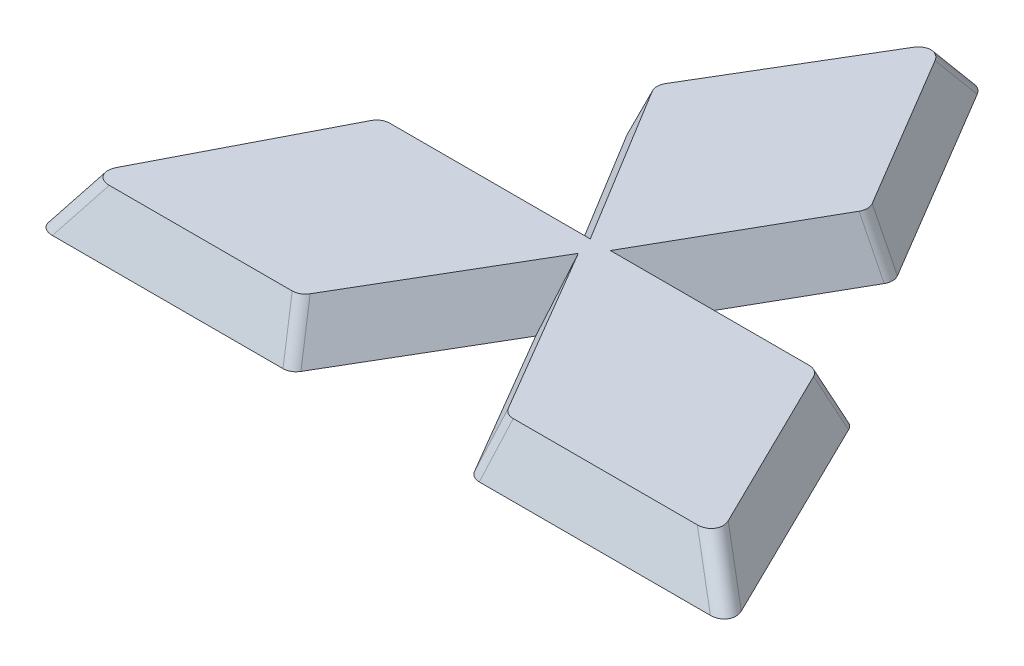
ISO-10303-21;
HEADER;
FILE_DESCRIPTION(('STEP AP214'),'2;1');
FILE_NAME('part.step','',(''),(''),'','','');
FILE_SCHEMA(('AUTOMOTIVE_DESIGN { 1 0 10303 214 1 1 1 1 }'));
ENDSEC;
DATA;
#1=APPLICATION_CONTEXT('core data for automotive mechanical design processes');
#2=APPLICATION_PROTOCOL_DEFINITION('international standard','automotive_design',2000,#1);
#3=PRODUCT_CONTEXT('',#1,'mechanical');
#4=PRODUCT('Part','Part','',(#3));
#5=PRODUCT_RELATED_PRODUCT_CATEGORY('part','',(#4));
#6=PRODUCT_DEFINITION_FORMATION('','',#4);
#7=PRODUCT_DEFINITION_CONTEXT('part definition',#1,'design');
#8=PRODUCT_DEFINITION('design','',#6,#7);
#9=PRODUCT_DEFINITION_SHAPE('','',#8);
#10=(LENGTH_UNIT() NAMED_UNIT(*) SI_UNIT(.MILLI.,.METRE.));
#11=(NAMED_UNIT(*) PLANE_ANGLE_UNIT() SI_UNIT($,.RADIAN.));
#12=(NAMED_UNIT(*) SI_UNIT($,.STERADIAN.) SOLID_ANGLE_UNIT());
#13=UNCERTAINTY_MEASURE_WITH_UNIT(LENGTH_MEASURE(1.E-05),#10,'distance_accuracy_value','');
#14=(GEOMETRIC_REPRESENTATION_CONTEXT(3) GLOBAL_UNCERTAINTY_ASSIGNED_CONTEXT((#13)) GLOBAL_UNIT_ASSIGNED_CONTEXT((#10,
#11,#12)) REPRESENTATION_CONTEXT('',''));
#15=CARTESIAN_POINT('',(0.,0.,0.));
#16=DIRECTION('',(0.,0.,1.));
#17=DIRECTION('',(1.,0.,0.));
#18=AXIS2_PLACEMENT_3D('',#15,#16,#17);
#19=CARTESIAN_POINT('',(0.,0.,0.));
#20=DIRECTION('',(0.,-1.,0.));
#21=DIRECTION('',(0.,0.,-1.));
#22=AXIS2_PLACEMENT_3D('',#19,#20,#21);
#23=PLANE('',#22);
#24=DIRECTION('',(-0.511435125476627,0.,0.859321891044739));
#25=VECTOR('',#24,1.);
#26=CARTESIAN_POINT('',(0.,0.,-42.));
#27=LINE('',#26,#25);
#28=CARTESIAN_POINT('',(-1.57968289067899,0.,-39.3457902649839));
#29=VERTEX_POINT('',#28);
#30=CARTESIAN_POINT('',(-17.8834969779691,0.,-11.9518478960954));
#31=VERTEX_POINT('',#30);
#32=EDGE_CURVE('E419',#29,#31,#27,.T.);
#33=ORIENTED_EDGE('',*,*,#32,.F.);
#34=CARTESIAN_POINT('',(0.,0.,-37.7454326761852));
#35=DIRECTION('',(0.,-1.,0.));
#36=DIRECTION('',(0.,0.,-1.));
#37=AXIS2_PLACEMENT_3D('',#34,#35,#36);
#38=ELLIPSE('',#37,2.60937331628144,2.);
#39=CARTESIAN_POINT('',(1.57968289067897,0.,-39.3457902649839));
#40=VERTEX_POINT('',#39);
#41=EDGE_CURVE('E845',#29,#40,#38,.T.);
#42=ORIENTED_EDGE('',*,*,#41,.T.);
#43=DIRECTION('',(-0.511435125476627,0.,-0.859321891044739));
#44=VECTOR('',#43,1.);
#45=CARTESIAN_POINT('',(0.,0.,-42.));
#46=LINE('',#45,#44);
#47=CARTESIAN_POINT('',(17.9023421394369,0.,-11.9201839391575));
#48=VERTEX_POINT('',#47);
#49=EDGE_CURVE('E658',#48,#40,#46,.T.);
#50=ORIENTED_EDGE('',*,*,#49,.F.);
#51=CARTESIAN_POINT('',(15.9319231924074,0.,-10.976347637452));
#52=DIRECTION('',(0.,-1.,0.));
#53=DIRECTION('',(0.999955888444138,0.,-0.00939261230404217));
#54=AXIS2_PLACEMENT_3D('',#51,#52,#53);
#55=ELLIPSE('',#54,2.23248520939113,2.);
#56=CARTESIAN_POINT('',(17.9197238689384,0.,-10.0696909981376));
#57=VERTEX_POINT('',#56);
#58=EDGE_CURVE('E835',#48,#57,#55,.T.);
#59=ORIENTED_EDGE('',*,*,#58,.T.);
#60=DIRECTION('',(0.495203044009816,0.,-0.868777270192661));
#61=VECTOR('',#60,1.);
#62=CARTESIAN_POINT('',(18.45,0.,-11.));
#63=LINE('',#62,#61);
#64=CARTESIAN_POINT('',(7.05000000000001,0.,9.00000000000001));
#65=VERTEX_POINT('',#64);
#66=EDGE_CURVE('E279',#65,#57,#63,.T.);
#67=ORIENTED_EDGE('',*,*,#66,.F.);
#68=DIRECTION('',(-1.,0.,0.));
#69=VECTOR('',#68,1.);
#70=CARTESIAN_POINT('',(32.55,0.,9.));
#71=LINE('',#70,#69);
#72=CARTESIAN_POINT('',(31.4045816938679,0.,9.));
#73=VERTEX_POINT('',#72);
#74=EDGE_CURVE('E232',#73,#65,#71,.T.);
#75=ORIENTED_EDGE('',*,*,#74,.F.);
#76=CARTESIAN_POINT('',(31.1941987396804,0.,11.175935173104));
#77=DIRECTION('',(0.,-1.,0.));
#78=DIRECTION('',(0.528832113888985,0.,-0.848726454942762));
#79=AXIS2_PLACEMENT_3D('',#76,#77,#78);
#80=ELLIPSE('',#79,2.24052033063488,2.);
#81=CARTESIAN_POINT('',(33.05475513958,0.,10.0282049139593));
#82=VERTEX_POINT('',#81);
#83=EDGE_CURVE('E830',#73,#82,#80,.T.);
#84=ORIENTED_EDGE('',*,*,#83,.T.);
#85=DIRECTION('',(-0.440673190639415,0.,-0.89766761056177));
#86=VECTOR('',#85,1.);
#87=CARTESIAN_POINT('',(32.55,0.,9.));
#88=LINE('',#87,#86);
#89=CARTESIAN_POINT('',(47.4498885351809,0.,39.351624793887));
#90=VERTEX_POINT('',#89);
#91=EDGE_CURVE('E510',#90,#82,#88,.T.);
#92=ORIENTED_EDGE('',*,*,#91,.F.);
#93=CARTESIAN_POINT('',(45.2578260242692,0.,39.824064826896));
#94=DIRECTION('',(0.,-1.,0.));
#95=DIRECTION('',(0.848726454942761,0.,0.528832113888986));
#96=AXIS2_PLACEMENT_3D('',#93,#94,#95);
#97=ELLIPSE('',#96,2.57430860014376,2.);
#98=CARTESIAN_POINT('',(45.7997150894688,0.,42.));
#99=VERTEX_POINT('',#98);
#100=EDGE_CURVE('E825',#90,#99,#97,.T.);
#101=ORIENTED_EDGE('',*,*,#100,.T.);
#102=DIRECTION('',(1.,0.,0.));
#103=VECTOR('',#102,1.);
#104=CARTESIAN_POINT('',(48.75,0.,42.));
#105=LINE('',#104,#103);
#106=CARTESIAN_POINT('',(13.6533891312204,0.,42.));
#107=VERTEX_POINT('',#106);
#108=EDGE_CURVE('E504',#107,#99,#105,.T.);
#109=ORIENTED_EDGE('',*,*,#108,.F.);
#110=CARTESIAN_POINT('',(13.846868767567,0.,39.824064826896));
#111=DIRECTION('',(0.,-1.,0.));
#112=DIRECTION('',(-0.497183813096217,0.,0.867645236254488));
#113=AXIS2_PLACEMENT_3D('',#110,#111,#112);
#114=ELLIPSE('',#113,2.23068097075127,2.);
#115=CARTESIAN_POINT('',(12.0673890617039,0.,41.0911797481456));
#116=VERTEX_POINT('',#115);
#117=EDGE_CURVE('E815',#107,#116,#114,.T.);
#118=ORIENTED_EDGE('',*,*,#117,.T.);
#119=DIRECTION('',(0.505616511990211,0.,0.862758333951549));
#120=VECTOR('',#119,1.);
#121=CARTESIAN_POINT('',(12.6,0.,42.));
#122=LINE('',#121,#120);
#123=CARTESIAN_POINT('',(0.,0.,20.5));
#124=VERTEX_POINT('',#123);
#125=EDGE_CURVE('E509',#124,#116,#122,.T.);
#126=ORIENTED_EDGE('',*,*,#125,.F.);
#127=DIRECTION('',(0.50561651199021,0.,-0.86275833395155));
#128=VECTOR('',#127,1.);
#129=CARTESIAN_POINT('',(-12.6,0.,42.));
#130=LINE('',#129,#128);
#131=CARTESIAN_POINT('',(-12.067389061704,0.,41.0911797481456));
#132=VERTEX_POINT('',#131);
#133=EDGE_CURVE('E516',#132,#124,#130,.T.);
#134=ORIENTED_EDGE('',*,*,#133,.F.);
#135=CARTESIAN_POINT('',(-13.846868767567,0.,39.824064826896));
#136=DIRECTION('',(0.,-1.,0.));
#137=DIRECTION('',(0.497183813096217,0.,0.867645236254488));
#138=AXIS2_PLACEMENT_3D('',#135,#136,#137);
#139=ELLIPSE('',#138,2.23068097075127,2.);
#140=CARTESIAN_POINT('',(-13.6533891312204,0.,42.));
#141=VERTEX_POINT('',#140);
#142=EDGE_CURVE('E820',#132,#141,#139,.T.);
#143=ORIENTED_EDGE('',*,*,#142,.T.);
#144=DIRECTION('',(1.,0.,0.));
#145=VECTOR('',#144,1.);
#146=CARTESIAN_POINT('',(-48.75,0.,42.));
#147=LINE('',#146,#145);
#148=CARTESIAN_POINT('',(-45.7351250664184,0.,42.));
#149=VERTEX_POINT('',#148);
#150=EDGE_CURVE('E790',#149,#141,#147,.T.);
#151=ORIENTED_EDGE('',*,*,#150,.F.);
#152=CARTESIAN_POINT('',(-45.1813725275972,0.,39.824064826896));
#153=DIRECTION('',(0.,-1.,0.));
#154=DIRECTION('',(-0.853802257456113,0.,0.520597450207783));
#155=AXIS2_PLACEMENT_3D('',#152,#153,#154);
#156=ELLIPSE('',#155,2.59052705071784,2.);
#157=CARTESIAN_POINT('',(-47.3693181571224,0.,39.3198528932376));
#158=VERTEX_POINT('',#157);
#159=EDGE_CURVE('E682',#149,#158,#156,.T.);
#160=ORIENTED_EDGE('',*,*,#159,.T.);
#161=DIRECTION('',(-0.457956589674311,0.,0.888974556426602));
#162=VECTOR('',#161,1.);
#163=CARTESIAN_POINT('',(-31.75,0.,9.00000000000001));
#164=LINE('',#163,#162);
#165=CARTESIAN_POINT('',(-32.2633139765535,0.,9.9964330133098));
#166=VERTEX_POINT('',#165);
#167=EDGE_CURVE('E799',#166,#158,#164,.T.);
#168=ORIENTED_EDGE('',*,*,#167,.F.);
#169=CARTESIAN_POINT('',(-30.4232451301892,0.,11.175935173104));
#170=DIRECTION('',(0.,-1.,0.));
#171=DIRECTION('',(-0.520597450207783,0.,-0.853802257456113));
#172=AXIS2_PLACEMENT_3D('',#169,#170,#171);
#173=ELLIPSE('',#172,2.23782048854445,2.);
#174=CARTESIAN_POINT('',(-30.6291208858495,0.,9.00000000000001));
#175=VERTEX_POINT('',#174);
#176=EDGE_CURVE('E679',#166,#175,#173,.T.);
#177=ORIENTED_EDGE('',*,*,#176,.T.);
#178=DIRECTION('',(-1.,0.,0.));
#179=VECTOR('',#178,1.);
#180=CARTESIAN_POINT('',(-6.24999999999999,0.,9.));
#181=LINE('',#180,#179);
#182=CARTESIAN_POINT('',(-6.24999999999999,0.,9.));
#183=VERTEX_POINT('',#182);
#184=EDGE_CURVE('E654',#183,#175,#181,.T.);
#185=ORIENTED_EDGE('',*,*,#184,.F.);
#186=DIRECTION('',(0.520759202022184,0.,0.85370360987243));
#187=VECTOR('',#186,1.);
#188=CARTESIAN_POINT('',(-18.45,0.,-11.));
#189=LINE('',#188,#187);
#190=CARTESIAN_POINT('',(-17.8731689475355,0.,-10.0543753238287));
#191=VERTEX_POINT('',#190);
#192=EDGE_CURVE('E651',#191,#183,#189,.T.);
#193=ORIENTED_EDGE('',*,*,#192,.F.);
#194=CARTESIAN_POINT('',(-15.9096166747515,0.,-11.0138274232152));
#195=DIRECTION('',(0.,-1.,0.));
#196=DIRECTION('',(-0.999985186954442,0.,0.00544296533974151));
#197=AXIS2_PLACEMENT_3D('',#194,#195,#196);
#198=ELLIPSE('',#197,2.23639044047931,2.);
#199=EDGE_CURVE('E840',#191,#31,#198,.T.);
#200=ORIENTED_EDGE('',*,*,#199,.T.);
#201=EDGE_LOOP('',(#33,#42,#50,#59,#67,#75,#84,#92,#101,#109,#118,#126,#134,#143,#151,#160,#168,
#177,#185,#193,#200));
#202=FACE_BOUND('',#201,.T.);
#203=ADVANCED_FACE('F65',(#202),#23,.T.);
#204=CARTESIAN_POINT('',(0.,7.,0.));
#205=DIRECTION('',(0.,1.,0.));
#206=DIRECTION('',(0.,0.,1.));
#207=AXIS2_PLACEMENT_3D('',#204,#205,#206);
#208=PLANE('',#207);
#209=DIRECTION('',(-0.511435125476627,0.,-0.859321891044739));
#210=VECTOR('',#209,1.);
#211=CARTESIAN_POINT('',(14.9782833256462,7.,-10.9673900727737));
#212=LINE('',#211,#210);
#213=CARTESIAN_POINT('',(14.4306254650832,7.,-11.8875740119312));
#214=VERTEX_POINT('',#213);
#215=CARTESIAN_POINT('',(1.57968289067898,7.,-33.4799436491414));
#216=VERTEX_POINT('',#215);
#217=EDGE_CURVE('E282',#214,#216,#212,.T.);
#218=ORIENTED_EDGE('',*,*,#217,.T.);
#219=CARTESIAN_POINT('',(0.,7.,-31.8795860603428));
#220=DIRECTION('',(0.,1.,0.));
#221=DIRECTION('',(0.,0.,-1.));
#222=AXIS2_PLACEMENT_3D('',#219,#220,#221);
#223=ELLIPSE('',#222,2.60937331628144,2.);
#224=CARTESIAN_POINT('',(-1.57968289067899,7.,-33.4799436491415));
#225=VERTEX_POINT('',#224);
#226=EDGE_CURVE('E576',#216,#225,#223,.T.);
#227=ORIENTED_EDGE('',*,*,#226,.T.);
#228=DIRECTION('',(-0.511435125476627,0.,0.859321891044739));
#229=VECTOR('',#228,1.);
#230=CARTESIAN_POINT('',(0.,7.,-36.1341533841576));
#231=LINE('',#230,#229);
#232=CARTESIAN_POINT('',(-14.3810259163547,7.,-11.9709120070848));
#233=VERTEX_POINT('',#232);
#234=EDGE_CURVE('E286',#225,#233,#231,.T.);
#235=ORIENTED_EDGE('',*,*,#234,.T.);
#236=CARTESIAN_POINT('',(-12.4071456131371,7.,-11.0328915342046));
#237=DIRECTION('',(0.,1.,0.));
#238=DIRECTION('',(-0.999985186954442,0.,0.00544296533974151));
#239=AXIS2_PLACEMENT_3D('',#236,#237,#238);
#240=ELLIPSE('',#239,2.23639044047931,2.);
#241=CARTESIAN_POINT('',(-14.3706978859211,7.,-10.073439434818));
#242=VERTEX_POINT('',#241);
#243=EDGE_CURVE('E571',#233,#242,#240,.T.);
#244=ORIENTED_EDGE('',*,*,#243,.T.);
#245=DIRECTION('',(0.520759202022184,0.,0.85370360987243));
#246=VECTOR('',#245,1.);
#247=CARTESIAN_POINT('',(-14.9475289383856,7.,-11.0190641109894));
#248=LINE('',#247,#246);
#249=CARTESIAN_POINT('',(-0.905899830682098,7.,12.));
#250=VERTEX_POINT('',#249);
#251=EDGE_CURVE('E662',#242,#250,#248,.T.);
#252=ORIENTED_EDGE('',*,*,#251,.T.);
#253=DIRECTION('',(-1.,0.,0.));
#254=VECTOR('',#253,1.);
#255=CARTESIAN_POINT('',(-0.905899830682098,7.,12.));
#256=LINE('',#255,#254);
#257=CARTESIAN_POINT('',(-28.7999006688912,7.,12.));
#258=VERTEX_POINT('',#257);
#259=EDGE_CURVE('E664',#250,#258,#256,.T.);
#260=ORIENTED_EDGE('',*,*,#259,.T.);
#261=CARTESIAN_POINT('',(-28.5940249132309,7.,14.175935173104));
#262=DIRECTION('',(0.,1.,0.));
#263=DIRECTION('',(-0.520597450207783,0.,-0.853802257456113));
#264=AXIS2_PLACEMENT_3D('',#261,#262,#263);
#265=ELLIPSE('',#264,2.23782048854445,2.);
#266=CARTESIAN_POINT('',(-30.4340937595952,7.,12.9964330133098));
#267=VERTEX_POINT('',#266);
#268=EDGE_CURVE('E551',#258,#267,#265,.T.);
#269=ORIENTED_EDGE('',*,*,#268,.T.);
#270=DIRECTION('',(-0.457956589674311,0.,0.888974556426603));
#271=VECTOR('',#270,1.);
#272=CARTESIAN_POINT('',(-29.9207797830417,7.,12.));
#273=LINE('',#272,#271);
#274=CARTESIAN_POINT('',(-42.449188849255,7.,36.3198528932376));
#275=VERTEX_POINT('',#274);
#276=EDGE_CURVE('E69',#267,#275,#273,.T.);
#277=ORIENTED_EDGE('',*,*,#276,.T.);
#278=CARTESIAN_POINT('',(-40.2612432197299,7.,36.824064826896));
#279=DIRECTION('',(0.,1.,0.));
#280=DIRECTION('',(-0.853802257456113,0.,0.520597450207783));
#281=AXIS2_PLACEMENT_3D('',#278,#279,#280);
#282=ELLIPSE('',#281,2.59052705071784,2.);
#283=CARTESIAN_POINT('',(-40.814995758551,7.,39.));
#284=VERTEX_POINT('',#283);
#285=EDGE_CURVE('E545',#275,#284,#282,.T.);
#286=ORIENTED_EDGE('',*,*,#285,.T.);
#287=DIRECTION('',(1.,0.,0.));
#288=VECTOR('',#287,1.);
#289=CARTESIAN_POINT('',(-43.8298706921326,7.,39.));
#290=LINE('',#289,#288);
#291=CARTESIAN_POINT('',(-15.3724689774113,7.,39.));
#292=VERTEX_POINT('',#291);
#293=EDGE_CURVE('E881',#284,#292,#290,.T.);
#294=ORIENTED_EDGE('',*,*,#293,.T.);
#295=CARTESIAN_POINT('',(-15.5659486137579,7.,36.824064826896));
#296=DIRECTION('',(0.,1.,0.));
#297=DIRECTION('',(0.497183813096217,0.,0.867645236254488));
#298=AXIS2_PLACEMENT_3D('',#295,#296,#297);
#299=ELLIPSE('',#298,2.23068097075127,2.);
#300=CARTESIAN_POINT('',(-13.7864689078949,7.,38.0911797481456));
#301=VERTEX_POINT('',#300);
#302=EDGE_CURVE('E544',#292,#301,#299,.T.);
#303=ORIENTED_EDGE('',*,*,#302,.T.);
#304=DIRECTION('',(0.50561651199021,0.,-0.86275833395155));
#305=VECTOR('',#304,1.);
#306=CARTESIAN_POINT('',(-14.3190798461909,7.,39.));
#307=LINE('',#306,#305);
#308=CARTESIAN_POINT('',(0.,7.,14.5666494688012));
#309=VERTEX_POINT('',#308);
#310=EDGE_CURVE('E511',#301,#309,#307,.T.);
#311=ORIENTED_EDGE('',*,*,#310,.T.);
#312=DIRECTION('',(0.505616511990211,0.,0.862758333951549));
#313=VECTOR('',#312,1.);
#314=CARTESIAN_POINT('',(0.,7.,14.5666494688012));
#315=LINE('',#314,#313);
#316=CARTESIAN_POINT('',(13.7864689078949,7.,38.0911797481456));
#317=VERTEX_POINT('',#316);
#318=EDGE_CURVE('E517',#309,#317,#315,.T.);
#319=ORIENTED_EDGE('',*,*,#318,.T.);
#320=CARTESIAN_POINT('',(15.5659486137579,7.,36.824064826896));
#321=DIRECTION('',(0.,1.,0.));
#322=DIRECTION('',(-0.497183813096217,0.,0.867645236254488));
#323=AXIS2_PLACEMENT_3D('',#320,#321,#322);
#324=ELLIPSE('',#323,2.23068097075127,2.);
#325=CARTESIAN_POINT('',(15.3724689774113,7.,39.));
#326=VERTEX_POINT('',#325);
#327=EDGE_CURVE('E528',#317,#326,#324,.T.);
#328=ORIENTED_EDGE('',*,*,#327,.T.);
#329=DIRECTION('',(1.,0.,0.));
#330=VECTOR('',#329,1.);
#331=CARTESIAN_POINT('',(14.3190798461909,7.,39.));
#332=LINE('',#331,#330);
#333=CARTESIAN_POINT('',(40.9849935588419,7.,39.));
#334=VERTEX_POINT('',#333);
#335=EDGE_CURVE('E522',#326,#334,#332,.T.);
#336=ORIENTED_EDGE('',*,*,#335,.T.);
#337=CARTESIAN_POINT('',(40.4431044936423,7.,36.824064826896));
#338=DIRECTION('',(0.,1.,0.));
#339=DIRECTION('',(0.848726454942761,0.,0.528832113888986));
#340=AXIS2_PLACEMENT_3D('',#337,#338,#339);
#341=ELLIPSE('',#340,2.57430860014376,2.);
#342=CARTESIAN_POINT('',(42.6351670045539,7.,36.351624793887));
#343=VERTEX_POINT('',#342);
#344=EDGE_CURVE('E549',#334,#343,#341,.T.);
#345=ORIENTED_EDGE('',*,*,#344,.T.);
#346=DIRECTION('',(-0.440673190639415,0.,-0.89766761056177));
#347=VECTOR('',#346,1.);
#348=CARTESIAN_POINT('',(43.935278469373,7.,39.));
#349=LINE('',#348,#347);
#350=CARTESIAN_POINT('',(31.1854881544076,7.,13.0282049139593));
#351=VERTEX_POINT('',#350);
#352=EDGE_CURVE('E224',#343,#351,#349,.T.);
#353=ORIENTED_EDGE('',*,*,#352,.T.);
#354=CARTESIAN_POINT('',(29.324931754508,7.,14.175935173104));
#355=DIRECTION('',(0.,1.,0.));
#356=DIRECTION('',(0.528832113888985,0.,-0.848726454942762));
#357=AXIS2_PLACEMENT_3D('',#354,#355,#356);
#358=ELLIPSE('',#357,2.24052033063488,2.);
#359=CARTESIAN_POINT('',(29.5353147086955,7.,12.));
#360=VERTEX_POINT('',#359);
#361=EDGE_CURVE('E92',#351,#360,#358,.T.);
#362=ORIENTED_EDGE('',*,*,#361,.T.);
#363=DIRECTION('',(-1.,0.,0.));
#364=VECTOR('',#363,1.);
#365=CARTESIAN_POINT('',(30.6807330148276,7.,12.));
#366=LINE('',#365,#364);
#367=CARTESIAN_POINT('',(1.88687098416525,7.,12.));
#368=VERTEX_POINT('',#367);
#369=EDGE_CURVE('E211',#360,#368,#366,.T.);
#370=ORIENTED_EDGE('',*,*,#369,.T.);
#371=DIRECTION('',(0.495203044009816,0.,-0.868777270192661));
#372=VECTOR('',#371,1.);
#373=CARTESIAN_POINT('',(1.88687098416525,7.,12.));
#374=LINE('',#373,#372);
#375=CARTESIAN_POINT('',(14.4480071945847,7.,-10.0370810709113));
#376=VERTEX_POINT('',#375);
#377=EDGE_CURVE('E216',#368,#376,#374,.T.);
#378=ORIENTED_EDGE('',*,*,#377,.T.);
#379=CARTESIAN_POINT('',(12.4602065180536,7.,-10.9437377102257));
#380=DIRECTION('',(0.,1.,0.));
#381=DIRECTION('',(0.999955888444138,0.,-0.00939261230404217));
#382=AXIS2_PLACEMENT_3D('',#379,#380,#381);
#383=ELLIPSE('',#382,2.23248520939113,2.);
#384=EDGE_CURVE('E566',#376,#214,#383,.T.);
#385=ORIENTED_EDGE('',*,*,#384,.T.);
#386=EDGE_LOOP('',(#218,#227,#235,#244,#252,#260,#269,#277,#286,#294,#303,#311,#319,#328,#336,
#345,#353,#362,#370,#378,#385));
#387=FACE_BOUND('',#386,.T.);
#388=ADVANCED_FACE('F215',(#387),#208,.T.);
#389=CARTESIAN_POINT('',(-18.1023315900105,8.72706879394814,-9.32544354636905));
#390=DIRECTION('',(-0.817096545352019,0.393919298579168,-0.420928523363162));
#391=DIRECTION('',(-0.457956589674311,0.,0.888974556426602));
#392=AXIS2_PLACEMENT_3D('',#389,#390,#391);
#393=PLANE('',#392);
#394=ORIENTED_EDGE('',*,*,#167,.T.);
#395=DIRECTION('',(-0.542650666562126,-0.772043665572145,0.330875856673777));
#396=VECTOR('',#395,1.);
#397=CARTESIAN_POINT('',(-26.3606073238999,29.8896566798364,26.5100000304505));
#398=LINE('',#397,#396);
#399=EDGE_CURVE('E76',#158,#275,#398,.F.);
#400=ORIENTED_EDGE('',*,*,#399,.T.);
#401=ORIENTED_EDGE('',*,*,#276,.F.);
#402=DIRECTION('',(-0.233546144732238,-0.893726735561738,-0.383025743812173));
#403=VECTOR('',#402,1.);
#404=CARTESIAN_POINT('',(-31.3977729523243,3.31222403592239,11.4159576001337));
#405=LINE('',#404,#403);
#406=EDGE_CURVE('E637',#267,#166,#405,.T.);
#407=ORIENTED_EDGE('',*,*,#406,.T.);
#408=EDGE_LOOP('',(#394,#400,#401,#407));
#409=FACE_BOUND('',#408,.T.);
#410=ADVANCED_FACE('F306',(#409),#393,.T.);
#411=CARTESIAN_POINT('',(0.,15.2068965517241,35.4827586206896));
#412=DIRECTION('',(0.,0.393919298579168,0.919145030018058));
#413=DIRECTION('',(0.,-0.919145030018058,0.393919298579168));
#414=AXIS2_PLACEMENT_3D('',#411,#412,#413);
#415=PLANE('',#414);
#416=ORIENTED_EDGE('',*,*,#150,.T.);
#417=DIRECTION('',(0.220186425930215,-0.896587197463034,0.384251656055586));
#418=VECTOR('',#417,1.);
#419=CARTESIAN_POINT('',(-16.5449386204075,11.7742328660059,36.9539002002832));
#420=LINE('',#419,#418);
#421=EDGE_CURVE('E628',#141,#292,#420,.F.);
#422=ORIENTED_EDGE('',*,*,#421,.T.);
#423=ORIENTED_EDGE('',*,*,#293,.F.);
#424=DIRECTION('',(-0.542650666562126,-0.772043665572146,0.330875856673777));
#425=VECTOR('',#424,1.);
#426=CARTESIAN_POINT('',(-24.7264142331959,29.8896566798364,29.1901471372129));
#427=LINE('',#426,#425);
#428=EDGE_CURVE('E622',#284,#149,#427,.T.);
#429=ORIENTED_EDGE('',*,*,#428,.T.);
#430=EDGE_LOOP('',(#416,#422,#423,#429));
#431=FACE_BOUND('',#430,.T.);
#432=ADVANCED_FACE('F757',(#431),#415,.T.);
#433=CARTESIAN_POINT('',(0.,-3.25862068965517,7.60344827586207));
#434=DIRECTION('',(0.,0.393919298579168,-0.919145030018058));
#435=DIRECTION('',(0.,0.919145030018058,0.393919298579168));
#436=AXIS2_PLACEMENT_3D('',#433,#434,#435);
#437=PLANE('',#436);
#438=ORIENTED_EDGE('',*,*,#184,.T.);
#439=DIRECTION('',(-0.233546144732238,-0.893726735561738,-0.383025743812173));
#440=VECTOR('',#439,1.);
#441=CARTESIAN_POINT('',(-29.7635798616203,3.31222403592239,10.4195245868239));
#442=LINE('',#441,#440);
#443=EDGE_CURVE('E12',#175,#258,#442,.F.);
#444=ORIENTED_EDGE('',*,*,#443,.T.);
#445=ORIENTED_EDGE('',*,*,#259,.F.);
#446=DIRECTION('',(-0.574403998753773,-0.752386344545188,-0.322451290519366));
#447=VECTOR('',#446,1.);
#448=CARTESIAN_POINT('',(-0.905899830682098,7.,12.));
#449=LINE('',#448,#447);
#450=EDGE_CURVE('E237',#250,#183,#449,.T.);
#451=ORIENTED_EDGE('',*,*,#450,.T.);
#452=EDGE_LOOP('',(#438,#444,#445,#451));
#453=FACE_BOUND('',#452,.T.);
#454=ADVANCED_FACE('F765',(#453),#437,.T.);
#455=CARTESIAN_POINT('',(-7.2285371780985,3.62882910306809,4.4094076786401));
#456=DIRECTION('',(-0.784677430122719,0.393919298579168,0.47865323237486));
#457=DIRECTION('',(0.520759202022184,0.,0.85370360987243));
#458=AXIS2_PLACEMENT_3D('',#455,#456,#457);
#459=PLANE('',#458);
#460=ORIENTED_EDGE('',*,*,#251,.F.);
#461=DIRECTION('',(-0.447464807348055,-0.894298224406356,0.00243557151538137));
#462=VECTOR('',#461,1.);
#463=CARTESIAN_POINT('',(-14.3054756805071,7.13035237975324,-10.0737944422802));
#464=LINE('',#463,#462);
#465=EDGE_CURVE('E581',#242,#191,#464,.T.);
#466=ORIENTED_EDGE('',*,*,#465,.T.);
#467=ORIENTED_EDGE('',*,*,#192,.T.);
#468=ORIENTED_EDGE('',*,*,#450,.F.);
#469=EDGE_LOOP('',(#460,#466,#467,#468));
#470=FACE_BOUND('',#469,.T.);
#471=ADVANCED_FACE('F399',(#470),#459,.T.);
#472=CARTESIAN_POINT('',(-15.5942253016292,7.77734104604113,-9.28107925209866));
#473=DIRECTION('',(-0.789841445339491,0.393919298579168,-0.470083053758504));
#474=DIRECTION('',(-0.511435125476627,0.,0.859321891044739));
#475=AXIS2_PLACEMENT_3D('',#472,#473,#474);
#476=PLANE('',#475);
#477=ORIENTED_EDGE('',*,*,#234,.F.);
#478=DIRECTION('',(0.,-0.766467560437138,-0.642283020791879));
#479=VECTOR('',#478,1.);
#480=CARTESIAN_POINT('',(-1.57968289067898,19.3695036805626,-23.1145706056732));
#481=LINE('',#480,#479);
#482=EDGE_CURVE('E677',#225,#29,#481,.T.);
#483=ORIENTED_EDGE('',*,*,#482,.T.);
#484=ORIENTED_EDGE('',*,*,#32,.T.);
#485=DIRECTION('',(-0.447464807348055,-0.894298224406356,0.00243557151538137));
#486=VECTOR('',#485,1.);
#487=CARTESIAN_POINT('',(-14.3158037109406,7.13035237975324,-11.971267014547));
#488=LINE('',#487,#486);
#489=EDGE_CURVE('E378',#31,#233,#488,.F.);
#490=ORIENTED_EDGE('',*,*,#489,.T.);
#491=EDGE_LOOP('',(#477,#483,#484,#490));
#492=FACE_BOUND('',#491,.T.);
#493=ADVANCED_FACE('F391',(#492),#476,.T.);
#494=CARTESIAN_POINT('',(15.5942253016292,7.77734104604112,-9.28107925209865));
#495=DIRECTION('',(0.789841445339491,0.393919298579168,-0.470083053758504));
#496=DIRECTION('',(-0.511435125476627,0.,-0.859321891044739));
#497=AXIS2_PLACEMENT_3D('',#494,#495,#496);
#498=PLANE('',#497);
#499=ORIENTED_EDGE('',*,*,#49,.T.);
#500=DIRECTION('',(0.,-0.766467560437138,-0.64228302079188));
#501=VECTOR('',#500,1.);
#502=CARTESIAN_POINT('',(1.57968289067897,19.3695036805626,-23.1145706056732));
#503=LINE('',#502,#501);
#504=EDGE_CURVE('E860',#40,#216,#503,.F.);
#505=ORIENTED_EDGE('',*,*,#504,.T.);
#506=ORIENTED_EDGE('',*,*,#217,.F.);
#507=DIRECTION('',(0.444311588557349,-0.89586259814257,-0.0041734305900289));
#508=VECTOR('',#507,1.);
#509=CARTESIAN_POINT('',(14.3460872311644,7.17045389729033,-11.8867799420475));
#510=LINE('',#509,#508);
#511=EDGE_CURVE('E850',#214,#48,#510,.T.);
#512=ORIENTED_EDGE('',*,*,#511,.T.);
#513=EDGE_LOOP('',(#499,#505,#506,#512));
#514=FACE_BOUND('',#513,.T.);
#515=ADVANCED_FACE('F257',(#514),#498,.T.);
#516=CARTESIAN_POINT('',(7.76662389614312,3.83130776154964,4.42697562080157));
#517=DIRECTION('',(0.79853231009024,0.393919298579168,0.455163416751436));
#518=DIRECTION('',(0.495203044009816,0.,-0.868777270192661));
#519=AXIS2_PLACEMENT_3D('',#516,#517,#518);
#520=PLANE('',#519);
#521=ORIENTED_EDGE('',*,*,#66,.T.);
#522=DIRECTION('',(0.444311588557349,-0.89586259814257,-0.0041734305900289));
#523=VECTOR('',#522,1.);
#524=CARTESIAN_POINT('',(14.3634689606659,7.17045389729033,-10.0362870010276));
#525=LINE('',#524,#523);
#526=EDGE_CURVE('E84',#57,#376,#525,.F.);
#527=ORIENTED_EDGE('',*,*,#526,.T.);
#528=ORIENTED_EDGE('',*,*,#377,.F.);
#529=DIRECTION('',(0.561150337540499,-0.76078911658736,-0.32605247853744));
#530=VECTOR('',#529,1.);
#531=CARTESIAN_POINT('',(1.88687098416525,7.,12.));
#532=LINE('',#531,#530);
#533=EDGE_CURVE('E229',#368,#65,#532,.T.);
#534=ORIENTED_EDGE('',*,*,#533,.T.);
#535=EDGE_LOOP('',(#521,#527,#528,#534));
#536=FACE_BOUND('',#535,.T.);
#537=ADVANCED_FACE('F240',(#536),#520,.T.);
#538=CARTESIAN_POINT('',(0.,-3.25862068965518,7.60344827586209));
#539=DIRECTION('',(0.,0.393919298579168,-0.919145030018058));
#540=DIRECTION('',(0.,0.919145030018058,0.393919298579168));
#541=AXIS2_PLACEMENT_3D('',#538,#539,#540);
#542=PLANE('',#541);
#543=ORIENTED_EDGE('',*,*,#369,.F.);
#544=DIRECTION('',(0.238371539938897,-0.892649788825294,-0.38256419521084));
#545=VECTOR('',#544,1.);
#546=CARTESIAN_POINT('',(30.4408739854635,3.60887664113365,10.5466614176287));
#547=LINE('',#546,#545);
#548=EDGE_CURVE('E591',#360,#73,#547,.T.);
#549=ORIENTED_EDGE('',*,*,#548,.T.);
#550=ORIENTED_EDGE('',*,*,#74,.T.);
#551=ORIENTED_EDGE('',*,*,#533,.F.);
#552=EDGE_LOOP('',(#543,#549,#550,#551));
#553=FACE_BOUND('',#552,.T.);
#554=ADVANCED_FACE('F230',(#553),#542,.T.);
#555=CARTESIAN_POINT('',(19.1512444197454,9.14333555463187,-9.40151998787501));
#556=DIRECTION('',(0.825086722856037,0.393919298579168,-0.405042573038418));
#557=DIRECTION('',(-0.440673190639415,0.,-0.89766761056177));
#558=AXIS2_PLACEMENT_3D('',#555,#556,#557);
#559=PLANE('',#558);
#560=ORIENTED_EDGE('',*,*,#91,.T.);
#561=DIRECTION('',(0.238371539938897,-0.892649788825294,-0.38256419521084));
#562=VECTOR('',#561,1.);
#563=CARTESIAN_POINT('',(32.0910474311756,3.60887664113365,11.574866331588));
#564=LINE('',#563,#562);
#565=EDGE_CURVE('E602',#82,#351,#564,.F.);
#566=ORIENTED_EDGE('',*,*,#565,.T.);
#567=ORIENTED_EDGE('',*,*,#352,.F.);
#568=DIRECTION('',(0.534370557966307,-0.776907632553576,0.332960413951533));
#569=VECTOR('',#568,1.);
#570=CARTESIAN_POINT('',(26.8988750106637,29.8785908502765,26.5465144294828));
#571=LINE('',#570,#569);
#572=EDGE_CURVE('E596',#343,#90,#571,.T.);
#573=ORIENTED_EDGE('',*,*,#572,.T.);
#574=EDGE_LOOP('',(#560,#566,#567,#573));
#575=FACE_BOUND('',#574,.T.);
#576=ADVANCED_FACE('F703',(#575),#559,.T.);
#577=CARTESIAN_POINT('',(0.,15.2068965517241,35.4827586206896));
#578=DIRECTION('',(0.,0.393919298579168,0.919145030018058));
#579=DIRECTION('',(0.,-0.919145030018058,0.393919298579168));
#580=AXIS2_PLACEMENT_3D('',#577,#578,#579);
#581=PLANE('',#580);
#582=ORIENTED_EDGE('',*,*,#108,.T.);
#583=DIRECTION('',(0.534370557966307,-0.776907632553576,0.332960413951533));
#584=VECTOR('',#583,1.);
#585=CARTESIAN_POINT('',(25.2487015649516,29.8785908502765,29.1948896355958));
#586=LINE('',#585,#584);
#587=EDGE_CURVE('E611',#99,#334,#586,.F.);
#588=ORIENTED_EDGE('',*,*,#587,.T.);
#589=ORIENTED_EDGE('',*,*,#335,.F.);
#590=DIRECTION('',(-0.220186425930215,-0.896587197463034,0.384251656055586));
#591=VECTOR('',#590,1.);
#592=CARTESIAN_POINT('',(16.5449386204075,11.7742328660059,36.9539002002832));
#593=LINE('',#592,#591);
#594=EDGE_CURVE('E542',#326,#107,#593,.T.);
#595=ORIENTED_EDGE('',*,*,#594,.T.);
#596=EDGE_LOOP('',(#582,#588,#589,#595));
#597=FACE_BOUND('',#596,.T.);
#598=ADVANCED_FACE('F711',(#597),#581,.T.);
#599=CARTESIAN_POINT('',(-7.55496329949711,3.752894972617,4.42755988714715));
#600=DIRECTION('',(-0.793000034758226,0.393919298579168,0.464734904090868));
#601=DIRECTION('',(0.505616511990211,0.,0.862758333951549));
#602=AXIS2_PLACEMENT_3D('',#599,#600,#601);
#603=PLANE('',#602);
#604=ORIENTED_EDGE('',*,*,#125,.T.);
#605=DIRECTION('',(-0.220186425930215,-0.896587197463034,0.384251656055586));
#606=VECTOR('',#605,1.);
#607=CARTESIAN_POINT('',(14.958938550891,11.7742328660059,36.0450799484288));
#608=LINE('',#607,#606);
#609=EDGE_CURVE('E540',#116,#317,#608,.F.);
#610=ORIENTED_EDGE('',*,*,#609,.T.);
#611=ORIENTED_EDGE('',*,*,#318,.F.);
#612=DIRECTION('',(0.,-0.762833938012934,0.646594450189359));
#613=VECTOR('',#612,1.);
#614=CARTESIAN_POINT('',(0.,7.,14.5666494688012));
#615=LINE('',#614,#613);
#616=EDGE_CURVE('E236',#309,#124,#615,.T.);
#617=ORIENTED_EDGE('',*,*,#616,.T.);
#618=EDGE_LOOP('',(#604,#610,#611,#617));
#619=FACE_BOUND('',#618,.T.);
#620=ADVANCED_FACE('F949',(#619),#603,.T.);
#621=CARTESIAN_POINT('',(7.55496329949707,3.75289497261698,4.42755988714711));
#622=DIRECTION('',(0.793000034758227,0.393919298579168,0.464734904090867));
#623=DIRECTION('',(0.50561651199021,0.,-0.86275833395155));
#624=AXIS2_PLACEMENT_3D('',#621,#622,#623);
#625=PLANE('',#624);
#626=ORIENTED_EDGE('',*,*,#310,.F.);
#627=DIRECTION('',(0.220186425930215,-0.896587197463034,0.384251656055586));
#628=VECTOR('',#627,1.);
#629=CARTESIAN_POINT('',(-14.958938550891,11.7742328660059,36.0450799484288));
#630=LINE('',#629,#628);
#631=EDGE_CURVE('E616',#301,#132,#630,.T.);
#632=ORIENTED_EDGE('',*,*,#631,.T.);
#633=ORIENTED_EDGE('',*,*,#133,.T.);
#634=ORIENTED_EDGE('',*,*,#616,.F.);
#635=EDGE_LOOP('',(#626,#632,#633,#634));
#636=FACE_BOUND('',#635,.T.);
#637=ADVANCED_FACE('F439',(#636),#625,.T.);
#638=CARTESIAN_POINT('',(0.,18.5816650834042,-22.1744044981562));
#639=DIRECTION('',(0.,-0.766467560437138,-0.64228302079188));
#640=DIRECTION('',(0.,0.64228302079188,-0.766467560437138));
#641=AXIS2_PLACEMENT_3D('',#638,#639,#640);
#642=CYLINDRICAL_SURFACE('',#641,2.);
#643=ORIENTED_EDGE('',*,*,#226,.F.);
#644=ORIENTED_EDGE('',*,*,#504,.F.);
#645=ORIENTED_EDGE('',*,*,#41,.F.);
#646=ORIENTED_EDGE('',*,*,#482,.F.);
#647=EDGE_LOOP('',(#643,#644,#645,#646));
#648=FACE_BOUND('',#647,.T.);
#649=ADVANCED_FACE('F442',(#648),#642,.T.);
#650=CARTESIAN_POINT('',(-12.7361208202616,6.34251378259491,-11.0311009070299));
#651=DIRECTION('',(-0.447464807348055,-0.894298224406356,0.00243557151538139));
#652=DIRECTION('',(0.894300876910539,-0.447466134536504,0.));
#653=AXIS2_PLACEMENT_3D('',#650,#651,#652);
#654=CYLINDRICAL_SURFACE('',#653,2.);
#655=ORIENTED_EDGE('',*,*,#243,.F.);
#656=ORIENTED_EDGE('',*,*,#489,.F.);
#657=ORIENTED_EDGE('',*,*,#199,.F.);
#658=ORIENTED_EDGE('',*,*,#465,.F.);
#659=EDGE_LOOP('',(#655,#656,#657,#658));
#660=FACE_BOUND('',#659,.T.);
#661=ADVANCED_FACE('F889',(#660),#654,.T.);
#662=CARTESIAN_POINT('',(12.7664043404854,6.382615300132,-10.9466138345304));
#663=DIRECTION('',(0.444311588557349,-0.89586259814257,-0.00417343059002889));
#664=DIRECTION('',(0.895870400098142,0.444315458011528,0.));
#665=AXIS2_PLACEMENT_3D('',#662,#663,#664);
#666=CYLINDRICAL_SURFACE('',#665,2.);
#667=ORIENTED_EDGE('',*,*,#384,.F.);
#668=ORIENTED_EDGE('',*,*,#526,.F.);
#669=ORIENTED_EDGE('',*,*,#58,.F.);
#670=ORIENTED_EDGE('',*,*,#511,.F.);
#671=EDGE_LOOP('',(#667,#668,#669,#670));
#672=FACE_BOUND('',#671,.T.);
#673=ADVANCED_FACE('F924',(#672),#666,.T.);
#674=CARTESIAN_POINT('',(30.4408739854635,2.82103804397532,12.3849514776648));
#675=DIRECTION('',(0.238371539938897,-0.892649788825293,-0.38256419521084));
#676=DIRECTION('',(0.,0.393919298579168,-0.919145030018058));
#677=AXIS2_PLACEMENT_3D('',#674,#675,#676);
#678=CYLINDRICAL_SURFACE('',#677,2.);
#679=ORIENTED_EDGE('',*,*,#361,.F.);
#680=ORIENTED_EDGE('',*,*,#565,.F.);
#681=ORIENTED_EDGE('',*,*,#83,.F.);
#682=ORIENTED_EDGE('',*,*,#548,.F.);
#683=EDGE_LOOP('',(#679,#680,#681,#682));
#684=FACE_BOUND('',#683,.T.);
#685=ADVANCED_FACE('F976',(#684),#678,.T.);
#686=CARTESIAN_POINT('',(25.2487015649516,29.0907522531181,27.3565995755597));
#687=DIRECTION('',(0.534370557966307,-0.776907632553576,0.332960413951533));
#688=DIRECTION('',(0.823919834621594,0.566706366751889,0.));
#689=AXIS2_PLACEMENT_3D('',#686,#687,#688);
#690=CYLINDRICAL_SURFACE('',#689,2.);
#691=ORIENTED_EDGE('',*,*,#344,.F.);
#692=ORIENTED_EDGE('',*,*,#587,.F.);
#693=ORIENTED_EDGE('',*,*,#100,.F.);
#694=ORIENTED_EDGE('',*,*,#572,.F.);
#695=EDGE_LOOP('',(#691,#692,#693,#694));
#696=FACE_BOUND('',#695,.T.);
#697=ADVANCED_FACE('F983',(#696),#690,.T.);
#698=CARTESIAN_POINT('',(-16.5449386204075,10.9863942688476,35.1156101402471));
#699=DIRECTION('',(0.220186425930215,-0.896587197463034,0.384251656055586));
#700=DIRECTION('',(0.,-0.393919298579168,-0.919145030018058));
#701=AXIS2_PLACEMENT_3D('',#698,#699,#700);
#702=CYLINDRICAL_SURFACE('',#701,2.);
#703=ORIENTED_EDGE('',*,*,#302,.F.);
#704=ORIENTED_EDGE('',*,*,#421,.F.);
#705=ORIENTED_EDGE('',*,*,#142,.F.);
#706=ORIENTED_EDGE('',*,*,#631,.F.);
#707=EDGE_LOOP('',(#703,#704,#705,#706));
#708=FACE_BOUND('',#707,.T.);
#709=ADVANCED_FACE('F991',(#708),#702,.T.);
#710=CARTESIAN_POINT('',(16.5449386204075,10.9863942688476,35.1156101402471));
#711=DIRECTION('',(-0.220186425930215,-0.896587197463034,0.384251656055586));
#712=DIRECTION('',(0.,-0.393919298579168,-0.919145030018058));
#713=AXIS2_PLACEMENT_3D('',#710,#711,#712);
#714=CYLINDRICAL_SURFACE('',#713,2.);
#715=ORIENTED_EDGE('',*,*,#327,.F.);
#716=ORIENTED_EDGE('',*,*,#609,.F.);
#717=ORIENTED_EDGE('',*,*,#117,.F.);
#718=ORIENTED_EDGE('',*,*,#594,.F.);
#719=EDGE_LOOP('',(#715,#716,#717,#718));
#720=FACE_BOUND('',#719,.T.);
#721=ADVANCED_FACE('F539',(#720),#714,.T.);
#722=CARTESIAN_POINT('',(-24.7264142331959,29.1018180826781,27.3518570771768));
#723=DIRECTION('',(-0.542650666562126,-0.772043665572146,0.330875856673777));
#724=DIRECTION('',(0.818125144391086,-0.575040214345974,0.));
#725=AXIS2_PLACEMENT_3D('',#722,#723,#724);
#726=CYLINDRICAL_SURFACE('',#725,2.);
#727=ORIENTED_EDGE('',*,*,#285,.F.);
#728=ORIENTED_EDGE('',*,*,#399,.F.);
#729=ORIENTED_EDGE('',*,*,#159,.F.);
#730=ORIENTED_EDGE('',*,*,#428,.F.);
#731=EDGE_LOOP('',(#727,#728,#729,#730));
#732=FACE_BOUND('',#731,.T.);
#733=ADVANCED_FACE('F887',(#732),#726,.T.);
#734=CARTESIAN_POINT('',(-29.7635798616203,2.52438543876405,12.25781464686));
#735=DIRECTION('',(-0.233546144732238,-0.893726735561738,-0.383025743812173));
#736=DIRECTION('',(0.,0.393919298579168,-0.919145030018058));
#737=AXIS2_PLACEMENT_3D('',#734,#735,#736);
#738=CYLINDRICAL_SURFACE('',#737,2.);
#739=ORIENTED_EDGE('',*,*,#268,.F.);
#740=ORIENTED_EDGE('',*,*,#443,.F.);
#741=ORIENTED_EDGE('',*,*,#176,.F.);
#742=ORIENTED_EDGE('',*,*,#406,.F.);
#743=EDGE_LOOP('',(#739,#740,#741,#742));
#744=FACE_BOUND('',#743,.T.);
#745=ADVANCED_FACE('F67',(#744),#738,.T.);
#746=CLOSED_SHELL('',(#203,#388,#410,#432,#454,#471,#493,#515,#537,#554,#576,#598,#620,#637,
#649,#661,#673,#685,#697,#709,#721,#733,#745));
#747=MANIFOLD_SOLID_BREP('B2',#746);
#748=ADVANCED_BREP_SHAPE_REPRESENTATION('',(#18,#747),#14);
#749=SHAPE_DEFINITION_REPRESENTATION(#9,#748);
ENDSEC;
END-ISO-10303-21;
